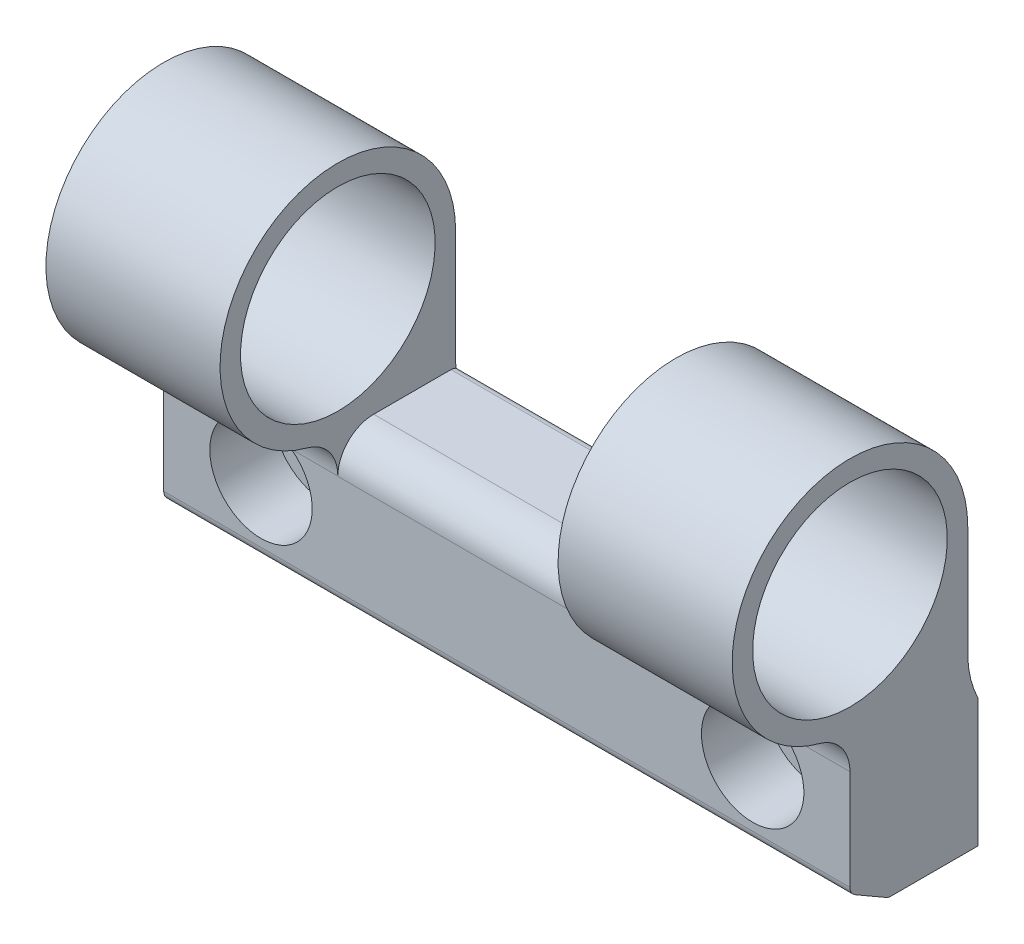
ISO-10303-21;
HEADER;
FILE_DESCRIPTION(('STEP AP214'),'2;1');
FILE_NAME('part.step','',(''),(''),'','','');
FILE_SCHEMA(('AUTOMOTIVE_DESIGN { 1 0 10303 214 1 1 1 1 }'));
ENDSEC;
DATA;
#1=APPLICATION_CONTEXT('core data for automotive mechanical design processes');
#2=APPLICATION_PROTOCOL_DEFINITION('international standard','automotive_design',2000,#1);
#3=PRODUCT_CONTEXT('',#1,'mechanical');
#4=PRODUCT('Part','Part','',(#3));
#5=PRODUCT_RELATED_PRODUCT_CATEGORY('part','',(#4));
#6=PRODUCT_DEFINITION_FORMATION('','',#4);
#7=PRODUCT_DEFINITION_CONTEXT('part definition',#1,'design');
#8=PRODUCT_DEFINITION('design','',#6,#7);
#9=PRODUCT_DEFINITION_SHAPE('','',#8);
#10=(LENGTH_UNIT() NAMED_UNIT(*) SI_UNIT(.MILLI.,.METRE.));
#11=(NAMED_UNIT(*) PLANE_ANGLE_UNIT() SI_UNIT($,.RADIAN.));
#12=(NAMED_UNIT(*) SI_UNIT($,.STERADIAN.) SOLID_ANGLE_UNIT());
#13=UNCERTAINTY_MEASURE_WITH_UNIT(LENGTH_MEASURE(1.E-05),#10,'distance_accuracy_value','');
#14=(GEOMETRIC_REPRESENTATION_CONTEXT(3) GLOBAL_UNCERTAINTY_ASSIGNED_CONTEXT((#13)) GLOBAL_UNIT_ASSIGNED_CONTEXT((#10,
#11,#12)) REPRESENTATION_CONTEXT('',''));
#15=CARTESIAN_POINT('',(0.,0.,0.));
#16=DIRECTION('',(0.,0.,1.));
#17=DIRECTION('',(1.,0.,0.));
#18=AXIS2_PLACEMENT_3D('',#15,#16,#17);
#19=CARTESIAN_POINT('',(57.5,4.02502086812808,16.5));
#20=DIRECTION('',(-1.,0.,0.));
#21=DIRECTION('',(0.,-1.,0.));
#22=AXIS2_PLACEMENT_3D('',#19,#20,#21);
#23=CYLINDRICAL_SURFACE('',#22,4.);
#24=DIRECTION('',(-1.,0.,0.));
#25=VECTOR('',#24,1.);
#26=CARTESIAN_POINT('',(57.5,4.02502086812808,12.5));
#27=LINE('',#26,#25);
#28=CARTESIAN_POINT('',(-2.9663457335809,4.02502086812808,12.5));
#29=VERTEX_POINT('',#28);
#30=CARTESIAN_POINT('',(-9.5,4.02502086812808,12.5));
#31=VERTEX_POINT('',#30);
#32=EDGE_CURVE('E156',#29,#31,#27,.T.);
#33=ORIENTED_EDGE('',*,*,#32,.F.);
#34=CARTESIAN_POINT('',(-2.9663457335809,4.02502086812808,12.5));
#35=CARTESIAN_POINT('',(-2.85427097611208,4.10763603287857,12.500022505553));
#36=CARTESIAN_POINT('',(-2.73876926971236,4.18551584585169,12.5025597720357));
#37=CARTESIAN_POINT('',(-2.50181636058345,4.33130646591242,12.5110695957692));
#38=CARTESIAN_POINT('',(-2.3803676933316,4.39922147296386,12.5170407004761));
#39=CARTESIAN_POINT('',(-2.13224254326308,4.5246985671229,12.5308314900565));
#40=CARTESIAN_POINT('',(-2.00556247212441,4.58225339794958,12.5386524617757));
#41=CARTESIAN_POINT('',(-1.74786156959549,4.68660888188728,12.5547378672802));
#42=CARTESIAN_POINT('',(-1.61684034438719,4.73340855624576,12.5630023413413));
#43=CARTESIAN_POINT('',(-1.3513403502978,4.81593191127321,12.5787470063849));
#44=CARTESIAN_POINT('',(-1.21686238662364,4.8516581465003,12.5862273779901));
#45=CARTESIAN_POINT('',(-0.945315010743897,4.91179354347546,12.5994123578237));
#46=CARTESIAN_POINT('',(-0.808245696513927,4.9362031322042,12.6051170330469));
#47=CARTESIAN_POINT('',(-0.532623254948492,4.97349264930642,12.6140291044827));
#48=CARTESIAN_POINT('',(-0.394071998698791,4.98638569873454,12.6172393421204));
#49=CARTESIAN_POINT('',(-0.116340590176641,5.00057975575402,12.6207811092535));
#50=CARTESIAN_POINT('',(0.0228395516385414,5.00188095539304,12.621112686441));
#51=CARTESIAN_POINT('',(0.299797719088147,4.99291299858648,12.6188654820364));
#52=CARTESIAN_POINT('',(0.437578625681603,4.98272706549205,12.6163076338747));
#53=CARTESIAN_POINT('',(0.711757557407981,4.95100467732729,12.6086224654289));
#54=CARTESIAN_POINT('',(0.848155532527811,4.92946781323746,12.6034950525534));
#55=CARTESIAN_POINT('',(1.11872476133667,4.8751934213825,12.591294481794));
#56=CARTESIAN_POINT('',(1.25289413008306,4.84244687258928,12.5842197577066));
#57=CARTESIAN_POINT('',(1.51800427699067,4.76599327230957,12.5690360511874));
#58=CARTESIAN_POINT('',(1.64894532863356,4.7222871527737,12.5609271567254));
#59=CARTESIAN_POINT('',(1.88362651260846,4.63300797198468,12.5462663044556));
#60=CARTESIAN_POINT('',(1.98803225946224,4.58917647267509,12.539696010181));
#61=CARTESIAN_POINT('',(2.19365140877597,4.49451890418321,12.5273625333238));
#62=CARTESIAN_POINT('',(2.29486549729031,4.44369435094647,12.5215991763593));
#63=CARTESIAN_POINT('',(2.49351285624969,4.33533935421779,12.5116843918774));
#64=CARTESIAN_POINT('',(2.59095199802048,4.27781993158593,12.5075303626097));
#65=CARTESIAN_POINT('',(2.78180056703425,4.15624966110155,12.5016922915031));
#66=CARTESIAN_POINT('',(2.87520819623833,4.09219594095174,12.5000093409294));
#67=CARTESIAN_POINT('',(2.9663457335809,4.02502086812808,12.5));
#68=B_SPLINE_CURVE_WITH_KNOTS('',3,(#34,#35,#36,#37,#38,#39,#40,#41,#42,#43,#44,#45,#46,#47,#48,
#49,#50,#51,#52,#53,#54,#55,#56,#57,#58,#59,#60,#61,#62,#63,#64,#65,#66,#67),.UNSPECIFIED.,.F.,
.F.,(4,2,2,2,2,2,2,2,2,2,2,2,2,2,2,2,4),(0.,0.417486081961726,0.834795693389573,
1.25239646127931,1.67003521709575,2.08757755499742,2.50510413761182,2.92215441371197,
3.33919778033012,3.75323900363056,4.16729514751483,4.58168529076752,4.99604020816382,
5.33606034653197,5.67600689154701,6.01540153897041,6.35494602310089),.UNSPECIFIED.);
#69=CARTESIAN_POINT('',(2.9663457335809,4.02502086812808,12.5));
#70=VERTEX_POINT('',#69);
#71=EDGE_CURVE('E27',#29,#70,#68,.T.);
#72=ORIENTED_EDGE('',*,*,#71,.T.);
#73=CARTESIAN_POINT('',(7.5,4.02502086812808,12.5));
#74=VERTEX_POINT('',#73);
#75=EDGE_CURVE('E154',#74,#70,#27,.T.);
#76=ORIENTED_EDGE('',*,*,#75,.F.);
#77=CARTESIAN_POINT('',(7.5,4.02502086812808,16.5));
#78=DIRECTION('',(1.,0.,0.));
#79=DIRECTION('',(0.,1.,0.));
#80=AXIS2_PLACEMENT_3D('',#77,#78,#79);
#81=CIRCLE('',#80,4.);
#82=CARTESIAN_POINT('',(7.5,7.88953161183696,15.4677419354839));
#83=VERTEX_POINT('',#82);
#84=EDGE_CURVE('E420',#74,#83,#81,.T.);
#85=ORIENTED_EDGE('',*,*,#84,.T.);
#86=DIRECTION('',(-1.,0.,0.));
#87=VECTOR('',#86,1.);
#88=CARTESIAN_POINT('',(57.5,7.88953161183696,15.4677419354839));
#89=LINE('',#88,#87);
#90=CARTESIAN_POINT('',(-9.5,7.88953161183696,15.4677419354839));
#91=VERTEX_POINT('',#90);
#92=EDGE_CURVE('E171',#83,#91,#89,.T.);
#93=ORIENTED_EDGE('',*,*,#92,.T.);
#94=CARTESIAN_POINT('',(-9.5,4.02502086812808,16.5));
#95=DIRECTION('',(1.,0.,0.));
#96=DIRECTION('',(0.,1.,0.));
#97=AXIS2_PLACEMENT_3D('',#94,#95,#96);
#98=CIRCLE('',#97,4.);
#99=EDGE_CURVE('E375',#31,#91,#98,.T.);
#100=ORIENTED_EDGE('',*,*,#99,.F.);
#101=EDGE_LOOP('',(#33,#72,#76,#85,#93,#100));
#102=FACE_BOUND('',#101,.T.);
#103=ADVANCED_FACE('F14',(#102),#23,.F.);
#104=CARTESIAN_POINT('',(45.0336542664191,4.02502086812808,12.5));
#105=VERTEX_POINT('',#104);
#106=CARTESIAN_POINT('',(40.5,4.02502086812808,12.5));
#107=VERTEX_POINT('',#106);
#108=EDGE_CURVE('E164',#105,#107,#27,.T.);
#109=ORIENTED_EDGE('',*,*,#108,.F.);
#110=CARTESIAN_POINT('',(45.0336542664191,4.02502086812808,12.5));
#111=CARTESIAN_POINT('',(45.1457290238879,4.10763603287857,12.500022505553));
#112=CARTESIAN_POINT('',(45.2612307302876,4.18551584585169,12.5025597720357));
#113=CARTESIAN_POINT('',(45.4981836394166,4.33130646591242,12.5110695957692));
#114=CARTESIAN_POINT('',(45.6196323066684,4.39922147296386,12.5170407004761));
#115=CARTESIAN_POINT('',(45.8677574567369,4.5246985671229,12.5308314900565));
#116=CARTESIAN_POINT('',(45.9944375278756,4.58225339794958,12.5386524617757));
#117=CARTESIAN_POINT('',(46.2521384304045,4.68660888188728,12.5547378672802));
#118=CARTESIAN_POINT('',(46.3831596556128,4.73340855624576,12.5630023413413));
#119=CARTESIAN_POINT('',(46.6486596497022,4.81593191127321,12.5787470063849));
#120=CARTESIAN_POINT('',(46.7831376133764,4.8516581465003,12.5862273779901));
#121=CARTESIAN_POINT('',(47.0546849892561,4.91179354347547,12.5994123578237));
#122=CARTESIAN_POINT('',(47.1917543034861,4.9362031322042,12.6051170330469));
#123=CARTESIAN_POINT('',(47.4673767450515,4.97349264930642,12.6140291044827));
#124=CARTESIAN_POINT('',(47.6059280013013,4.98638569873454,12.6172393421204));
#125=CARTESIAN_POINT('',(47.8836594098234,5.00057975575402,12.6207811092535));
#126=CARTESIAN_POINT('',(48.0228395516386,5.00188095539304,12.621112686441));
#127=CARTESIAN_POINT('',(48.2997977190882,4.99291299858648,12.6188654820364));
#128=CARTESIAN_POINT('',(48.4375786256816,4.98272706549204,12.6163076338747));
#129=CARTESIAN_POINT('',(48.711757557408,4.95100467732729,12.6086224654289));
#130=CARTESIAN_POINT('',(48.8481555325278,4.92946781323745,12.6034950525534));
#131=CARTESIAN_POINT('',(49.1187247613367,4.87519342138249,12.591294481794));
#132=CARTESIAN_POINT('',(49.2528941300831,4.84244687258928,12.5842197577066));
#133=CARTESIAN_POINT('',(49.5180042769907,4.76599327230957,12.5690360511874));
#134=CARTESIAN_POINT('',(49.6489453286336,4.7222871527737,12.5609271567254));
#135=CARTESIAN_POINT('',(49.8836265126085,4.63300797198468,12.5462663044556));
#136=CARTESIAN_POINT('',(49.9880322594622,4.58917647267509,12.539696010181));
#137=CARTESIAN_POINT('',(50.193651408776,4.49451890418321,12.5273625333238));
#138=CARTESIAN_POINT('',(50.2948654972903,4.44369435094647,12.5215991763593));
#139=CARTESIAN_POINT('',(50.4935128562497,4.33533935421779,12.5116843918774));
#140=CARTESIAN_POINT('',(50.5909519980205,4.27781993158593,12.5075303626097));
#141=CARTESIAN_POINT('',(50.7818005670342,4.15624966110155,12.5016922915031));
#142=CARTESIAN_POINT('',(50.8752081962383,4.09219594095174,12.5000093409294));
#143=CARTESIAN_POINT('',(50.9663457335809,4.02502086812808,12.5));
#144=B_SPLINE_CURVE_WITH_KNOTS('',3,(#110,#111,#112,#113,#114,#115,#116,#117,#118,#119,#120,
#121,#122,#123,#124,#125,#126,#127,#128,#129,#130,#131,#132,#133,#134,#135,#136,#137,#138,#139,
#140,#141,#142,#143),.UNSPECIFIED.,.F.,.F.,(4,2,2,2,2,2,2,2,2,2,2,2,2,2,2,2,4),(0.,
0.417486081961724,0.834795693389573,1.2523964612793,1.67003521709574,2.08757755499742,
2.50510413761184,2.92215441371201,3.33919778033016,3.75323900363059,4.16729514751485,
4.58168529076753,4.99604020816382,5.33606034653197,5.67600689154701,6.01540153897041,
6.35494602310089),.UNSPECIFIED.);
#145=CARTESIAN_POINT('',(50.9663457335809,4.02502086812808,12.5));
#146=VERTEX_POINT('',#145);
#147=EDGE_CURVE('E34',#105,#146,#144,.T.);
#148=ORIENTED_EDGE('',*,*,#147,.T.);
#149=CARTESIAN_POINT('',(57.5,4.02502086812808,12.5));
#150=VERTEX_POINT('',#149);
#151=EDGE_CURVE('E166',#150,#146,#27,.T.);
#152=ORIENTED_EDGE('',*,*,#151,.F.);
#153=CARTESIAN_POINT('',(57.5,4.02502086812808,16.5));
#154=DIRECTION('',(1.,0.,0.));
#155=DIRECTION('',(0.,1.,0.));
#156=AXIS2_PLACEMENT_3D('',#153,#154,#155);
#157=CIRCLE('',#156,4.);
#158=CARTESIAN_POINT('',(57.5,7.88953161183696,15.4677419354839));
#159=VERTEX_POINT('',#158);
#160=EDGE_CURVE('E351',#150,#159,#157,.T.);
#161=ORIENTED_EDGE('',*,*,#160,.T.);
#162=CARTESIAN_POINT('',(40.5,7.88953161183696,15.4677419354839));
#163=VERTEX_POINT('',#162);
#164=EDGE_CURVE('E173',#159,#163,#89,.T.);
#165=ORIENTED_EDGE('',*,*,#164,.T.);
#166=CARTESIAN_POINT('',(40.5,4.02502086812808,16.5));
#167=DIRECTION('',(1.,0.,0.));
#168=DIRECTION('',(0.,1.,0.));
#169=AXIS2_PLACEMENT_3D('',#166,#167,#168);
#170=CIRCLE('',#169,4.);
#171=EDGE_CURVE('E409',#107,#163,#170,.T.);
#172=ORIENTED_EDGE('',*,*,#171,.F.);
#173=EDGE_LOOP('',(#109,#148,#152,#161,#165,#172));
#174=FACE_BOUND('',#173,.T.);
#175=ADVANCED_FACE('F207',(#174),#23,.F.);
#176=CARTESIAN_POINT('',(57.5,8.,1.));
#177=DIRECTION('',(0.,0.,1.));
#178=DIRECTION('',(1.,0.,0.));
#179=AXIS2_PLACEMENT_3D('',#176,#177,#178);
#180=PLANE('',#179);
#181=DIRECTION('',(0.,1.,0.));
#182=VECTOR('',#181,1.);
#183=CARTESIAN_POINT('',(7.5,8.,1.));
#184=LINE('',#183,#182);
#185=CARTESIAN_POINT('',(7.5,8.,1.));
#186=VERTEX_POINT('',#185);
#187=CARTESIAN_POINT('',(7.5,19.,1.));
#188=VERTEX_POINT('',#187);
#189=EDGE_CURVE('E416',#186,#188,#184,.T.);
#190=ORIENTED_EDGE('',*,*,#189,.F.);
#191=DIRECTION('',(-1.,0.,0.));
#192=VECTOR('',#191,1.);
#193=CARTESIAN_POINT('',(57.5,8.,1.));
#194=LINE('',#193,#192);
#195=CARTESIAN_POINT('',(-9.5,8.,1.));
#196=VERTEX_POINT('',#195);
#197=EDGE_CURVE('E182',#186,#196,#194,.T.);
#198=ORIENTED_EDGE('',*,*,#197,.T.);
#199=DIRECTION('',(0.,1.,0.));
#200=VECTOR('',#199,1.);
#201=CARTESIAN_POINT('',(-9.5,8.,1.));
#202=LINE('',#201,#200);
#203=CARTESIAN_POINT('',(-9.5,19.,1.));
#204=VERTEX_POINT('',#203);
#205=EDGE_CURVE('E370',#196,#204,#202,.T.);
#206=ORIENTED_EDGE('',*,*,#205,.T.);
#207=DIRECTION('',(-1.,0.,0.));
#208=VECTOR('',#207,1.);
#209=CARTESIAN_POINT('',(57.5,19.,1.));
#210=LINE('',#209,#208);
#211=EDGE_CURVE('E177',#188,#204,#210,.T.);
#212=ORIENTED_EDGE('',*,*,#211,.F.);
#213=EDGE_LOOP('',(#190,#198,#206,#212));
#214=FACE_BOUND('',#213,.T.);
#215=ADVANCED_FACE('F294',(#214),#180,.F.);
#216=CARTESIAN_POINT('',(57.5,19.,12.5));
#217=DIRECTION('',(-1.,0.,0.));
#218=DIRECTION('',(0.,-1.,0.));
#219=AXIS2_PLACEMENT_3D('',#216,#217,#218);
#220=CYLINDRICAL_SURFACE('',#219,11.5);
#221=CARTESIAN_POINT('',(7.5,19.,12.5));
#222=DIRECTION('',(1.,0.,0.));
#223=DIRECTION('',(0.,1.,0.));
#224=AXIS2_PLACEMENT_3D('',#221,#222,#223);
#225=CIRCLE('',#224,11.5);
#226=EDGE_CURVE('E418',#188,#83,#225,.T.);
#227=ORIENTED_EDGE('',*,*,#226,.F.);
#228=ORIENTED_EDGE('',*,*,#211,.T.);
#229=CARTESIAN_POINT('',(-9.5,19.,12.5));
#230=DIRECTION('',(1.,0.,0.));
#231=DIRECTION('',(0.,1.,0.));
#232=AXIS2_PLACEMENT_3D('',#229,#230,#231);
#233=CIRCLE('',#232,11.5);
#234=EDGE_CURVE('E373',#204,#91,#233,.T.);
#235=ORIENTED_EDGE('',*,*,#234,.T.);
#236=ORIENTED_EDGE('',*,*,#92,.F.);
#237=EDGE_LOOP('',(#227,#228,#235,#236));
#238=FACE_BOUND('',#237,.T.);
#239=ADVANCED_FACE('F288',(#238),#220,.T.);
#240=CARTESIAN_POINT('',(57.5,19.,12.5));
#241=DIRECTION('',(-1.,0.,0.));
#242=DIRECTION('',(0.,-1.,0.));
#243=AXIS2_PLACEMENT_3D('',#240,#241,#242);
#244=CYLINDRICAL_SURFACE('',#243,9.5);
#245=CARTESIAN_POINT('',(-9.5,19.,12.5));
#246=DIRECTION('',(1.,0.,0.));
#247=DIRECTION('',(0.,1.,0.));
#248=AXIS2_PLACEMENT_3D('',#245,#246,#247);
#249=CIRCLE('',#248,9.5);
#250=CARTESIAN_POINT('',(-9.5,28.5,12.5));
#251=VERTEX_POINT('',#250);
#252=EDGE_CURVE('E343',#251,#251,#249,.T.);
#253=ORIENTED_EDGE('',*,*,#252,.F.);
#254=EDGE_LOOP('',(#253));
#255=FACE_BOUND('',#254,.T.);
#256=CARTESIAN_POINT('',(7.5,19.,12.5));
#257=DIRECTION('',(1.,0.,0.));
#258=DIRECTION('',(0.,1.,0.));
#259=AXIS2_PLACEMENT_3D('',#256,#257,#258);
#260=CIRCLE('',#259,9.5);
#261=CARTESIAN_POINT('',(7.5,28.5,12.5));
#262=VERTEX_POINT('',#261);
#263=EDGE_CURVE('E195',#262,#262,#260,.T.);
#264=ORIENTED_EDGE('',*,*,#263,.T.);
#265=EDGE_LOOP('',(#264));
#266=FACE_BOUND('',#265,.T.);
#267=ADVANCED_FACE('F273',(#255,#266),#244,.F.);
#268=CARTESIAN_POINT('',(57.5,-7.5,8.48205080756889));
#269=DIRECTION('',(-1.,0.,0.));
#270=DIRECTION('',(0.,-1.,0.));
#271=AXIS2_PLACEMENT_3D('',#268,#269,#270);
#272=CYLINDRICAL_SURFACE('',#271,0.999999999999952);
#273=CARTESIAN_POINT('',(-9.5,-7.5,8.48205080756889));
#274=DIRECTION('',(1.,0.,0.));
#275=DIRECTION('',(0.,1.,0.));
#276=AXIS2_PLACEMENT_3D('',#273,#274,#275);
#277=CIRCLE('',#276,0.999999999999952);
#278=CARTESIAN_POINT('',(-9.5,-8.36602540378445,8.98205080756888));
#279=VERTEX_POINT('',#278);
#280=CARTESIAN_POINT('',(-9.5,-8.5,8.48205080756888));
#281=VERTEX_POINT('',#280);
#282=EDGE_CURVE('E330',#279,#281,#277,.T.);
#283=ORIENTED_EDGE('',*,*,#282,.T.);
#284=DIRECTION('',(-1.,0.,0.));
#285=VECTOR('',#284,1.);
#286=CARTESIAN_POINT('',(57.5,-8.5,8.48205080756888));
#287=LINE('',#286,#285);
#288=CARTESIAN_POINT('',(57.5,-8.5,8.48205080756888));
#289=VERTEX_POINT('',#288);
#290=EDGE_CURVE('E191',#289,#281,#287,.T.);
#291=ORIENTED_EDGE('',*,*,#290,.F.);
#292=CARTESIAN_POINT('',(57.5,-7.5,8.48205080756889));
#293=DIRECTION('',(1.,0.,0.));
#294=DIRECTION('',(0.,1.,0.));
#295=AXIS2_PLACEMENT_3D('',#292,#293,#294);
#296=CIRCLE('',#295,0.999999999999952);
#297=CARTESIAN_POINT('',(57.5,-8.36602540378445,8.98205080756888));
#298=VERTEX_POINT('',#297);
#299=EDGE_CURVE('E339',#298,#289,#296,.T.);
#300=ORIENTED_EDGE('',*,*,#299,.F.);
#301=DIRECTION('',(-1.,0.,0.));
#302=VECTOR('',#301,1.);
#303=CARTESIAN_POINT('',(57.5,-8.36602540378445,8.98205080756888));
#304=LINE('',#303,#302);
#305=EDGE_CURVE('E361',#298,#279,#304,.T.);
#306=ORIENTED_EDGE('',*,*,#305,.T.);
#307=EDGE_LOOP('',(#283,#291,#300,#306));
#308=FACE_BOUND('',#307,.T.);
#309=ADVANCED_FACE('F16',(#308),#272,.T.);
#310=CARTESIAN_POINT('',(57.5,-8.5,8.48205080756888));
#311=DIRECTION('',(0.,1.,0.));
#312=DIRECTION('',(-1.,0.,0.));
#313=AXIS2_PLACEMENT_3D('',#310,#311,#312);
#314=PLANE('',#313);
#315=DIRECTION('',(0.,0.,-1.));
#316=VECTOR('',#315,1.);
#317=CARTESIAN_POINT('',(-9.5,-8.5,8.48205080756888));
#318=LINE('',#317,#316);
#319=CARTESIAN_POINT('',(-9.5,-8.5,0.));
#320=VERTEX_POINT('',#319);
#321=EDGE_CURVE('E333',#281,#320,#318,.T.);
#322=ORIENTED_EDGE('',*,*,#321,.T.);
#323=DIRECTION('',(-1.,0.,0.));
#324=VECTOR('',#323,1.);
#325=CARTESIAN_POINT('',(57.5,-8.5,0.));
#326=LINE('',#325,#324);
#327=CARTESIAN_POINT('',(57.5,-8.5,0.));
#328=VERTEX_POINT('',#327);
#329=EDGE_CURVE('E188',#328,#320,#326,.T.);
#330=ORIENTED_EDGE('',*,*,#329,.F.);
#331=DIRECTION('',(0.,0.,-1.));
#332=VECTOR('',#331,1.);
#333=CARTESIAN_POINT('',(57.5,-8.5,8.48205080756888));
#334=LINE('',#333,#332);
#335=EDGE_CURVE('E342',#289,#328,#334,.T.);
#336=ORIENTED_EDGE('',*,*,#335,.F.);
#337=ORIENTED_EDGE('',*,*,#290,.T.);
#338=EDGE_LOOP('',(#322,#330,#336,#337));
#339=FACE_BOUND('',#338,.T.);
#340=ADVANCED_FACE('F457',(#339),#314,.F.);
#341=CARTESIAN_POINT('',(57.5,-8.5,0.));
#342=DIRECTION('',(0.,0.,1.));
#343=DIRECTION('',(1.,0.,0.));
#344=AXIS2_PLACEMENT_3D('',#341,#342,#343);
#345=PLANE('',#344);
#346=CARTESIAN_POINT('',(0.,0.,0.));
#347=DIRECTION('',(0.,0.,-1.));
#348=DIRECTION('',(-1.,0.,0.));
#349=AXIS2_PLACEMENT_3D('',#346,#347,#348);
#350=CIRCLE('',#349,3.25);
#351=CARTESIAN_POINT('',(-3.25,0.,0.));
#352=VERTEX_POINT('',#351);
#353=EDGE_CURVE('E657',#352,#352,#350,.T.);
#354=ORIENTED_EDGE('',*,*,#353,.F.);
#355=EDGE_LOOP('',(#354));
#356=FACE_BOUND('',#355,.T.);
#357=CARTESIAN_POINT('',(48.,0.,0.));
#358=DIRECTION('',(0.,0.,-1.));
#359=DIRECTION('',(-1.,0.,0.));
#360=AXIS2_PLACEMENT_3D('',#357,#358,#359);
#361=CIRCLE('',#360,3.25);
#362=CARTESIAN_POINT('',(44.75,0.,0.));
#363=VERTEX_POINT('',#362);
#364=EDGE_CURVE('E157',#363,#363,#361,.T.);
#365=ORIENTED_EDGE('',*,*,#364,.F.);
#366=EDGE_LOOP('',(#365));
#367=FACE_BOUND('',#366,.T.);
#368=DIRECTION('',(0.,1.,0.));
#369=VECTOR('',#368,1.);
#370=CARTESIAN_POINT('',(-9.5,-8.5,0.));
#371=LINE('',#370,#369);
#372=CARTESIAN_POINT('',(-9.5,4.,0.));
#373=VERTEX_POINT('',#372);
#374=EDGE_CURVE('E364',#320,#373,#371,.T.);
#375=ORIENTED_EDGE('',*,*,#374,.T.);
#376=DIRECTION('',(-1.,0.,0.));
#377=VECTOR('',#376,1.);
#378=CARTESIAN_POINT('',(57.5,4.,0.));
#379=LINE('',#378,#377);
#380=CARTESIAN_POINT('',(57.5,4.,0.));
#381=VERTEX_POINT('',#380);
#382=EDGE_CURVE('E186',#381,#373,#379,.T.);
#383=ORIENTED_EDGE('',*,*,#382,.F.);
#384=DIRECTION('',(0.,1.,0.));
#385=VECTOR('',#384,1.);
#386=CARTESIAN_POINT('',(57.5,-8.5,0.));
#387=LINE('',#386,#385);
#388=EDGE_CURVE('E345',#328,#381,#387,.T.);
#389=ORIENTED_EDGE('',*,*,#388,.F.);
#390=ORIENTED_EDGE('',*,*,#329,.T.);
#391=EDGE_LOOP('',(#375,#383,#389,#390));
#392=FACE_BOUND('',#391,.T.);
#393=ADVANCED_FACE('F315',(#356,#367,#392),#345,.F.);
#394=CARTESIAN_POINT('',(57.5,8.37325787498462,-8.99303149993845));
#395=DIRECTION('',(-1.,0.,0.));
#396=DIRECTION('',(0.,-1.,0.));
#397=AXIS2_PLACEMENT_3D('',#394,#395,#396);
#398=CYLINDRICAL_SURFACE('',#397,10.);
#399=CARTESIAN_POINT('',(40.5,8.37325787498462,-8.99303149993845));
#400=DIRECTION('',(1.,0.,0.));
#401=DIRECTION('',(0.,1.,0.));
#402=AXIS2_PLACEMENT_3D('',#399,#400,#401);
#403=CIRCLE('',#402,10.);
#404=CARTESIAN_POINT('',(40.5,8.,1.));
#405=VERTEX_POINT('',#404);
#406=CARTESIAN_POINT('',(40.5,7.36760936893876,0.956273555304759));
#407=VERTEX_POINT('',#406);
#408=EDGE_CURVE('E327',#405,#407,#403,.T.);
#409=ORIENTED_EDGE('',*,*,#408,.F.);
#410=CARTESIAN_POINT('',(57.5,8.,1.));
#411=VERTEX_POINT('',#410);
#412=EDGE_CURVE('E183',#411,#405,#194,.T.);
#413=ORIENTED_EDGE('',*,*,#412,.F.);
#414=CARTESIAN_POINT('',(57.5,8.37325787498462,-8.99303149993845));
#415=DIRECTION('',(1.,0.,0.));
#416=DIRECTION('',(0.,1.,0.));
#417=AXIS2_PLACEMENT_3D('',#414,#415,#416);
#418=CIRCLE('',#417,10.);
#419=EDGE_CURVE('E325',#411,#381,#418,.T.);
#420=ORIENTED_EDGE('',*,*,#419,.T.);
#421=ORIENTED_EDGE('',*,*,#382,.T.);
#422=CARTESIAN_POINT('',(-9.5,8.37325787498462,-8.99303149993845));
#423=DIRECTION('',(1.,0.,0.));
#424=DIRECTION('',(0.,1.,0.));
#425=AXIS2_PLACEMENT_3D('',#422,#423,#424);
#426=CIRCLE('',#425,10.);
#427=EDGE_CURVE('E367',#196,#373,#426,.T.);
#428=ORIENTED_EDGE('',*,*,#427,.F.);
#429=ORIENTED_EDGE('',*,*,#197,.F.);
#430=CARTESIAN_POINT('',(7.5,8.37325787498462,-8.99303149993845));
#431=DIRECTION('',(1.,0.,0.));
#432=DIRECTION('',(0.,1.,0.));
#433=AXIS2_PLACEMENT_3D('',#430,#431,#432);
#434=CIRCLE('',#433,10.);
#435=CARTESIAN_POINT('',(7.5,7.36760936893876,0.956273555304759));
#436=VERTEX_POINT('',#435);
#437=EDGE_CURVE('E203',#186,#436,#434,.T.);
#438=ORIENTED_EDGE('',*,*,#437,.T.);
#439=DIRECTION('',(-1.,0.,0.));
#440=VECTOR('',#439,1.);
#441=CARTESIAN_POINT('',(24.,7.36760936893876,0.956273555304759));
#442=LINE('',#441,#440);
#443=EDGE_CURVE('E194',#407,#436,#442,.T.);
#444=ORIENTED_EDGE('',*,*,#443,.F.);
#445=EDGE_LOOP('',(#409,#413,#420,#421,#428,#429,#438,#444));
#446=FACE_BOUND('',#445,.T.);
#447=ADVANCED_FACE('F309',(#446),#398,.F.);
#448=ORIENTED_EDGE('',*,*,#412,.T.);
#449=DIRECTION('',(0.,1.,0.));
#450=VECTOR('',#449,1.);
#451=CARTESIAN_POINT('',(40.5,8.,1.));
#452=LINE('',#451,#450);
#453=CARTESIAN_POINT('',(40.5,19.,1.));
#454=VERTEX_POINT('',#453);
#455=EDGE_CURVE('E320',#405,#454,#452,.T.);
#456=ORIENTED_EDGE('',*,*,#455,.T.);
#457=CARTESIAN_POINT('',(57.5,19.,1.));
#458=VERTEX_POINT('',#457);
#459=EDGE_CURVE('E179',#458,#454,#210,.T.);
#460=ORIENTED_EDGE('',*,*,#459,.F.);
#461=DIRECTION('',(0.,1.,0.));
#462=VECTOR('',#461,1.);
#463=CARTESIAN_POINT('',(57.5,8.,1.));
#464=LINE('',#463,#462);
#465=EDGE_CURVE('E321',#411,#458,#464,.T.);
#466=ORIENTED_EDGE('',*,*,#465,.F.);
#467=EDGE_LOOP('',(#448,#456,#460,#466));
#468=FACE_BOUND('',#467,.T.);
#469=ADVANCED_FACE('F286',(#468),#180,.F.);
#470=ORIENTED_EDGE('',*,*,#459,.T.);
#471=CARTESIAN_POINT('',(40.5,19.,12.5));
#472=DIRECTION('',(1.,0.,0.));
#473=DIRECTION('',(0.,1.,0.));
#474=AXIS2_PLACEMENT_3D('',#471,#472,#473);
#475=CIRCLE('',#474,11.5);
#476=EDGE_CURVE('E335',#454,#163,#475,.T.);
#477=ORIENTED_EDGE('',*,*,#476,.T.);
#478=ORIENTED_EDGE('',*,*,#164,.F.);
#479=CARTESIAN_POINT('',(57.5,19.,12.5));
#480=DIRECTION('',(1.,0.,0.));
#481=DIRECTION('',(0.,1.,0.));
#482=AXIS2_PLACEMENT_3D('',#479,#480,#481);
#483=CIRCLE('',#482,11.5);
#484=EDGE_CURVE('E349',#458,#159,#483,.T.);
#485=ORIENTED_EDGE('',*,*,#484,.F.);
#486=EDGE_LOOP('',(#470,#477,#478,#485));
#487=FACE_BOUND('',#486,.T.);
#488=ADVANCED_FACE('F280',(#487),#220,.T.);
#489=CARTESIAN_POINT('',(57.5,4.02502086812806,12.5));
#490=DIRECTION('',(0.,0.,-1.));
#491=DIRECTION('',(-1.,0.,0.));
#492=AXIS2_PLACEMENT_3D('',#489,#490,#491);
#493=PLANE('',#492);
#494=ORIENTED_EDGE('',*,*,#75,.T.);
#495=CARTESIAN_POINT('',(0.,0.,12.5));
#496=DIRECTION('',(0.,0.,-1.));
#497=DIRECTION('',(-1.,0.,0.));
#498=AXIS2_PLACEMENT_3D('',#495,#496,#497);
#499=CIRCLE('',#498,5.);
#500=EDGE_CURVE('E9',#29,#70,#499,.F.);
#501=ORIENTED_EDGE('',*,*,#500,.F.);
#502=ORIENTED_EDGE('',*,*,#32,.T.);
#503=DIRECTION('',(0.,-1.,0.));
#504=VECTOR('',#503,1.);
#505=CARTESIAN_POINT('',(-9.5,4.02502086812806,12.5));
#506=LINE('',#505,#504);
#507=CARTESIAN_POINT('',(-9.5,-5.7575862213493,12.5));
#508=VERTEX_POINT('',#507);
#509=EDGE_CURVE('E378',#31,#508,#506,.T.);
#510=ORIENTED_EDGE('',*,*,#509,.T.);
#511=DIRECTION('',(-1.,0.,0.));
#512=VECTOR('',#511,1.);
#513=CARTESIAN_POINT('',(57.5,-5.7575862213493,12.5));
#514=LINE('',#513,#512);
#515=CARTESIAN_POINT('',(57.5,-5.7575862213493,12.5));
#516=VERTEX_POINT('',#515);
#517=EDGE_CURVE('E167',#516,#508,#514,.T.);
#518=ORIENTED_EDGE('',*,*,#517,.F.);
#519=DIRECTION('',(0.,-1.,0.));
#520=VECTOR('',#519,1.);
#521=CARTESIAN_POINT('',(57.5,4.02502086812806,12.5));
#522=LINE('',#521,#520);
#523=EDGE_CURVE('E353',#150,#516,#522,.T.);
#524=ORIENTED_EDGE('',*,*,#523,.F.);
#525=ORIENTED_EDGE('',*,*,#151,.T.);
#526=CARTESIAN_POINT('',(48.,0.,12.5));
#527=DIRECTION('',(0.,0.,-1.));
#528=DIRECTION('',(-1.,0.,0.));
#529=AXIS2_PLACEMENT_3D('',#526,#527,#528);
#530=CIRCLE('',#529,5.);
#531=EDGE_CURVE('E22',#105,#146,#530,.F.);
#532=ORIENTED_EDGE('',*,*,#531,.F.);
#533=ORIENTED_EDGE('',*,*,#108,.T.);
#534=DIRECTION('',(0.,-1.,0.));
#535=VECTOR('',#534,1.);
#536=CARTESIAN_POINT('',(40.5,4.02502086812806,12.5));
#537=LINE('',#536,#535);
#538=CARTESIAN_POINT('',(40.5,4.,12.5));
#539=VERTEX_POINT('',#538);
#540=EDGE_CURVE('E202',#107,#539,#537,.T.);
#541=ORIENTED_EDGE('',*,*,#540,.T.);
#542=DIRECTION('',(-1.,0.,0.));
#543=VECTOR('',#542,1.);
#544=CARTESIAN_POINT('',(40.5,4.,12.5));
#545=LINE('',#544,#543);
#546=CARTESIAN_POINT('',(7.5,4.,12.5));
#547=VERTEX_POINT('',#546);
#548=EDGE_CURVE('E198',#539,#547,#545,.T.);
#549=ORIENTED_EDGE('',*,*,#548,.T.);
#550=DIRECTION('',(0.,-1.,0.));
#551=VECTOR('',#550,1.);
#552=CARTESIAN_POINT('',(7.5,4.02502086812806,12.5));
#553=LINE('',#552,#551);
#554=EDGE_CURVE('E163',#74,#547,#553,.T.);
#555=ORIENTED_EDGE('',*,*,#554,.F.);
#556=EDGE_LOOP('',(#494,#501,#502,#510,#518,#524,#525,#532,#533,#541,#549,#555));
#557=FACE_BOUND('',#556,.T.);
#558=ADVANCED_FACE('F161',(#557),#493,.F.);
#559=CARTESIAN_POINT('',(57.5,-5.7575862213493,11.5));
#560=DIRECTION('',(-1.,0.,0.));
#561=DIRECTION('',(0.,-1.,0.));
#562=AXIS2_PLACEMENT_3D('',#559,#560,#561);
#563=CYLINDRICAL_SURFACE('',#562,1.);
#564=CARTESIAN_POINT('',(-9.5,-5.7575862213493,11.5));
#565=DIRECTION('',(1.,0.,0.));
#566=DIRECTION('',(0.,1.,0.));
#567=AXIS2_PLACEMENT_3D('',#564,#565,#566);
#568=CIRCLE('',#567,1.);
#569=CARTESIAN_POINT('',(-9.5,-6.6236116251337,12.));
#570=VERTEX_POINT('',#569);
#571=EDGE_CURVE('E380',#508,#570,#568,.T.);
#572=ORIENTED_EDGE('',*,*,#571,.T.);
#573=DIRECTION('',(-1.,0.,0.));
#574=VECTOR('',#573,1.);
#575=CARTESIAN_POINT('',(57.5,-6.6236116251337,12.));
#576=LINE('',#575,#574);
#577=CARTESIAN_POINT('',(57.5,-6.6236116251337,12.));
#578=VERTEX_POINT('',#577);
#579=EDGE_CURVE('E388',#578,#570,#576,.T.);
#580=ORIENTED_EDGE('',*,*,#579,.F.);
#581=CARTESIAN_POINT('',(57.5,-5.7575862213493,11.5));
#582=DIRECTION('',(1.,0.,0.));
#583=DIRECTION('',(0.,1.,0.));
#584=AXIS2_PLACEMENT_3D('',#581,#582,#583);
#585=CIRCLE('',#584,1.);
#586=EDGE_CURVE('E355',#516,#578,#585,.T.);
#587=ORIENTED_EDGE('',*,*,#586,.F.);
#588=ORIENTED_EDGE('',*,*,#517,.T.);
#589=EDGE_LOOP('',(#572,#580,#587,#588));
#590=FACE_BOUND('',#589,.T.);
#591=ADVANCED_FACE('F271',(#590),#563,.T.);
#592=CARTESIAN_POINT('',(40.5,19.,12.5));
#593=DIRECTION('',(1.,0.,0.));
#594=DIRECTION('',(0.,1.,0.));
#595=AXIS2_PLACEMENT_3D('',#592,#593,#594);
#596=CIRCLE('',#595,9.5);
#597=CARTESIAN_POINT('',(40.5,28.5,12.5));
#598=VERTEX_POINT('',#597);
#599=EDGE_CURVE('E199',#598,#598,#596,.T.);
#600=ORIENTED_EDGE('',*,*,#599,.F.);
#601=EDGE_LOOP('',(#600));
#602=FACE_BOUND('',#601,.T.);
#603=CARTESIAN_POINT('',(57.5,19.,12.5));
#604=DIRECTION('',(1.,0.,0.));
#605=DIRECTION('',(0.,1.,0.));
#606=AXIS2_PLACEMENT_3D('',#603,#604,#605);
#607=CIRCLE('',#606,9.5);
#608=CARTESIAN_POINT('',(57.5,28.5,12.5));
#609=VERTEX_POINT('',#608);
#610=EDGE_CURVE('E359',#609,#609,#607,.T.);
#611=ORIENTED_EDGE('',*,*,#610,.T.);
#612=EDGE_LOOP('',(#611));
#613=FACE_BOUND('',#612,.T.);
#614=ADVANCED_FACE('F268',(#602,#613),#244,.F.);
#615=CARTESIAN_POINT('',(57.5,-6.6236116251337,12.));
#616=DIRECTION('',(0.,0.866025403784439,-0.5));
#617=DIRECTION('',(0.,0.5,0.866025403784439));
#618=AXIS2_PLACEMENT_3D('',#615,#616,#617);
#619=PLANE('',#618);
#620=DIRECTION('',(0.,-0.5,-0.866025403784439));
#621=VECTOR('',#620,1.);
#622=CARTESIAN_POINT('',(-9.5,-6.6236116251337,12.));
#623=LINE('',#622,#621);
#624=EDGE_CURVE('E382',#570,#279,#623,.T.);
#625=ORIENTED_EDGE('',*,*,#624,.T.);
#626=ORIENTED_EDGE('',*,*,#305,.F.);
#627=DIRECTION('',(0.,-0.5,-0.866025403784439));
#628=VECTOR('',#627,1.);
#629=CARTESIAN_POINT('',(57.5,-6.6236116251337,12.));
#630=LINE('',#629,#628);
#631=EDGE_CURVE('E357',#578,#298,#630,.T.);
#632=ORIENTED_EDGE('',*,*,#631,.F.);
#633=ORIENTED_EDGE('',*,*,#579,.T.);
#634=EDGE_LOOP('',(#625,#626,#632,#633));
#635=FACE_BOUND('',#634,.T.);
#636=ADVANCED_FACE('F263',(#635),#619,.F.);
#637=CARTESIAN_POINT('',(57.5,-7.5,8.48205080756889));
#638=DIRECTION('',(1.,0.,0.));
#639=DIRECTION('',(0.,1.,0.));
#640=AXIS2_PLACEMENT_3D('',#637,#638,#639);
#641=PLANE('',#640);
#642=ORIENTED_EDGE('',*,*,#610,.F.);
#643=EDGE_LOOP('',(#642));
#644=FACE_BOUND('',#643,.T.);
#645=ORIENTED_EDGE('',*,*,#299,.T.);
#646=ORIENTED_EDGE('',*,*,#335,.T.);
#647=ORIENTED_EDGE('',*,*,#388,.T.);
#648=ORIENTED_EDGE('',*,*,#419,.F.);
#649=ORIENTED_EDGE('',*,*,#465,.T.);
#650=ORIENTED_EDGE('',*,*,#484,.T.);
#651=ORIENTED_EDGE('',*,*,#160,.F.);
#652=ORIENTED_EDGE('',*,*,#523,.T.);
#653=ORIENTED_EDGE('',*,*,#586,.T.);
#654=ORIENTED_EDGE('',*,*,#631,.T.);
#655=EDGE_LOOP('',(#645,#646,#647,#648,#649,#650,#651,#652,#653,#654));
#656=FACE_BOUND('',#655,.T.);
#657=ADVANCED_FACE('F260',(#644,#656),#641,.T.);
#658=CARTESIAN_POINT('',(-9.5,-7.5,8.48205080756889));
#659=DIRECTION('',(1.,0.,0.));
#660=DIRECTION('',(0.,1.,0.));
#661=AXIS2_PLACEMENT_3D('',#658,#659,#660);
#662=PLANE('',#661);
#663=ORIENTED_EDGE('',*,*,#252,.T.);
#664=EDGE_LOOP('',(#663));
#665=FACE_BOUND('',#664,.T.);
#666=ORIENTED_EDGE('',*,*,#282,.F.);
#667=ORIENTED_EDGE('',*,*,#624,.F.);
#668=ORIENTED_EDGE('',*,*,#571,.F.);
#669=ORIENTED_EDGE('',*,*,#509,.F.);
#670=ORIENTED_EDGE('',*,*,#99,.T.);
#671=ORIENTED_EDGE('',*,*,#234,.F.);
#672=ORIENTED_EDGE('',*,*,#205,.F.);
#673=ORIENTED_EDGE('',*,*,#427,.T.);
#674=ORIENTED_EDGE('',*,*,#374,.F.);
#675=ORIENTED_EDGE('',*,*,#321,.F.);
#676=EDGE_LOOP('',(#666,#667,#668,#669,#670,#671,#672,#673,#674,#675));
#677=FACE_BOUND('',#676,.T.);
#678=ADVANCED_FACE('F258',(#665,#677),#662,.F.);
#679=CARTESIAN_POINT('',(40.5,4.,9.));
#680=DIRECTION('',(-1.,0.,0.));
#681=DIRECTION('',(0.,-1.,0.));
#682=AXIS2_PLACEMENT_3D('',#679,#680,#681);
#683=CYLINDRICAL_SURFACE('',#682,3.5);
#684=CARTESIAN_POINT('',(7.5,4.,9.));
#685=DIRECTION('',(1.,0.,0.));
#686=DIRECTION('',(0.,1.,0.));
#687=AXIS2_PLACEMENT_3D('',#684,#685,#686);
#688=CIRCLE('',#687,3.5);
#689=CARTESIAN_POINT('',(7.5,7.5,9.00000005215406));
#690=VERTEX_POINT('',#689);
#691=EDGE_CURVE('E210',#690,#547,#688,.T.);
#692=ORIENTED_EDGE('',*,*,#691,.T.);
#693=ORIENTED_EDGE('',*,*,#548,.F.);
#694=CARTESIAN_POINT('',(40.5,4.,9.));
#695=DIRECTION('',(1.,0.,0.));
#696=DIRECTION('',(0.,1.,0.));
#697=AXIS2_PLACEMENT_3D('',#694,#695,#696);
#698=CIRCLE('',#697,3.5);
#699=CARTESIAN_POINT('',(40.5,7.5,9.00000005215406));
#700=VERTEX_POINT('',#699);
#701=EDGE_CURVE('E227',#700,#539,#698,.T.);
#702=ORIENTED_EDGE('',*,*,#701,.F.);
#703=DIRECTION('',(-1.,0.,0.));
#704=VECTOR('',#703,1.);
#705=CARTESIAN_POINT('',(40.5,7.5,9.00000005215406));
#706=LINE('',#705,#704);
#707=EDGE_CURVE('E424',#700,#690,#706,.T.);
#708=ORIENTED_EDGE('',*,*,#707,.T.);
#709=EDGE_LOOP('',(#692,#693,#702,#708));
#710=FACE_BOUND('',#709,.T.);
#711=ADVANCED_FACE('F254',(#710),#683,.T.);
#712=CARTESIAN_POINT('',(40.5,7.5,9.));
#713=DIRECTION('',(0.,1.,0.));
#714=DIRECTION('',(-1.,0.,0.));
#715=AXIS2_PLACEMENT_3D('',#712,#713,#714);
#716=PLANE('',#715);
#717=DIRECTION('',(0.,0.,-1.));
#718=VECTOR('',#717,1.);
#719=CARTESIAN_POINT('',(7.5,7.5,9.));
#720=LINE('',#719,#718);
#721=CARTESIAN_POINT('',(7.5,7.5,1.45351995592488));
#722=VERTEX_POINT('',#721);
#723=EDGE_CURVE('E214',#690,#722,#720,.T.);
#724=ORIENTED_EDGE('',*,*,#723,.F.);
#725=ORIENTED_EDGE('',*,*,#707,.F.);
#726=DIRECTION('',(0.,0.,-1.));
#727=VECTOR('',#726,1.);
#728=CARTESIAN_POINT('',(40.5,7.5,9.));
#729=LINE('',#728,#727);
#730=CARTESIAN_POINT('',(40.5,7.5,1.45351995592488));
#731=VERTEX_POINT('',#730);
#732=EDGE_CURVE('E434',#700,#731,#729,.T.);
#733=ORIENTED_EDGE('',*,*,#732,.T.);
#734=DIRECTION('',(-1.,0.,0.));
#735=VECTOR('',#734,1.);
#736=CARTESIAN_POINT('',(40.5,7.5,1.45351995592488));
#737=LINE('',#736,#735);
#738=EDGE_CURVE('E426',#731,#722,#737,.T.);
#739=ORIENTED_EDGE('',*,*,#738,.T.);
#740=EDGE_LOOP('',(#724,#725,#733,#739));
#741=FACE_BOUND('',#740,.T.);
#742=ADVANCED_FACE('F250',(#741),#716,.T.);
#743=CARTESIAN_POINT('',(40.5,6.5,1.4535199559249));
#744=DIRECTION('',(-1.,0.,0.));
#745=DIRECTION('',(0.,-1.,0.));
#746=AXIS2_PLACEMENT_3D('',#743,#744,#745);
#747=CYLINDRICAL_SURFACE('',#746,1.);
#748=ORIENTED_EDGE('',*,*,#443,.T.);
#749=CARTESIAN_POINT('',(7.5,6.5,1.4535199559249));
#750=DIRECTION('',(1.,0.,0.));
#751=DIRECTION('',(0.,1.,0.));
#752=AXIS2_PLACEMENT_3D('',#749,#750,#751);
#753=CIRCLE('',#752,1.);
#754=EDGE_CURVE('E430',#436,#722,#753,.T.);
#755=ORIENTED_EDGE('',*,*,#754,.T.);
#756=ORIENTED_EDGE('',*,*,#738,.F.);
#757=CARTESIAN_POINT('',(40.5,6.5,1.4535199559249));
#758=DIRECTION('',(1.,0.,0.));
#759=DIRECTION('',(0.,1.,0.));
#760=AXIS2_PLACEMENT_3D('',#757,#758,#759);
#761=CIRCLE('',#760,1.);
#762=EDGE_CURVE('E429',#407,#731,#761,.T.);
#763=ORIENTED_EDGE('',*,*,#762,.F.);
#764=EDGE_LOOP('',(#748,#755,#756,#763));
#765=FACE_BOUND('',#764,.T.);
#766=ADVANCED_FACE('F243',(#765),#747,.T.);
#767=CARTESIAN_POINT('',(40.5,13.9603032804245,-48.9978811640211));
#768=DIRECTION('',(1.,0.,0.));
#769=DIRECTION('',(0.,1.,0.));
#770=AXIS2_PLACEMENT_3D('',#767,#768,#769);
#771=PLANE('',#770);
#772=ORIENTED_EDGE('',*,*,#408,.T.);
#773=ORIENTED_EDGE('',*,*,#762,.T.);
#774=ORIENTED_EDGE('',*,*,#732,.F.);
#775=ORIENTED_EDGE('',*,*,#701,.T.);
#776=ORIENTED_EDGE('',*,*,#540,.F.);
#777=ORIENTED_EDGE('',*,*,#171,.T.);
#778=ORIENTED_EDGE('',*,*,#476,.F.);
#779=ORIENTED_EDGE('',*,*,#455,.F.);
#780=EDGE_LOOP('',(#772,#773,#774,#775,#776,#777,#778,#779));
#781=FACE_BOUND('',#780,.T.);
#782=ORIENTED_EDGE('',*,*,#599,.T.);
#783=EDGE_LOOP('',(#782));
#784=FACE_BOUND('',#783,.T.);
#785=ADVANCED_FACE('F240',(#781,#784),#771,.F.);
#786=CARTESIAN_POINT('',(7.5,13.9603032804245,-48.9978811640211));
#787=DIRECTION('',(1.,0.,0.));
#788=DIRECTION('',(0.,1.,0.));
#789=AXIS2_PLACEMENT_3D('',#786,#787,#788);
#790=PLANE('',#789);
#791=ORIENTED_EDGE('',*,*,#263,.F.);
#792=EDGE_LOOP('',(#791));
#793=FACE_BOUND('',#792,.T.);
#794=ORIENTED_EDGE('',*,*,#189,.T.);
#795=ORIENTED_EDGE('',*,*,#226,.T.);
#796=ORIENTED_EDGE('',*,*,#84,.F.);
#797=ORIENTED_EDGE('',*,*,#554,.T.);
#798=ORIENTED_EDGE('',*,*,#691,.F.);
#799=ORIENTED_EDGE('',*,*,#723,.T.);
#800=ORIENTED_EDGE('',*,*,#754,.F.);
#801=ORIENTED_EDGE('',*,*,#437,.F.);
#802=EDGE_LOOP('',(#794,#795,#796,#797,#798,#799,#800,#801));
#803=FACE_BOUND('',#802,.T.);
#804=ADVANCED_FACE('F237',(#793,#803),#790,.T.);
#805=CARTESIAN_POINT('',(48.,0.,0.));
#806=DIRECTION('',(0.,0.,-1.));
#807=DIRECTION('',(-1.,0.,0.));
#808=AXIS2_PLACEMENT_3D('',#805,#806,#807);
#809=CYLINDRICAL_SURFACE('',#808,5.);
#810=CARTESIAN_POINT('',(48.,0.,6.3));
#811=DIRECTION('',(0.,0.,-1.));
#812=DIRECTION('',(-1.,0.,0.));
#813=AXIS2_PLACEMENT_3D('',#810,#811,#812);
#814=CIRCLE('',#813,5.);
#815=CARTESIAN_POINT('',(43.,0.,6.3));
#816=VERTEX_POINT('',#815);
#817=EDGE_CURVE('E211',#816,#816,#814,.T.);
#818=ORIENTED_EDGE('',*,*,#817,.T.);
#819=EDGE_LOOP('',(#818));
#820=FACE_BOUND('',#819,.T.);
#821=ORIENTED_EDGE('',*,*,#531,.T.);
#822=ORIENTED_EDGE('',*,*,#147,.F.);
#823=EDGE_LOOP('',(#821,#822));
#824=FACE_BOUND('',#823,.T.);
#825=ADVANCED_FACE('F204',(#820,#824),#809,.F.);
#826=CARTESIAN_POINT('',(43.,0.,6.3));
#827=DIRECTION('',(0.,0.,1.));
#828=DIRECTION('',(1.,0.,0.));
#829=AXIS2_PLACEMENT_3D('',#826,#827,#828);
#830=PLANE('',#829);
#831=CARTESIAN_POINT('',(48.,0.,6.3));
#832=DIRECTION('',(0.,0.,-1.));
#833=DIRECTION('',(-1.,0.,0.));
#834=AXIS2_PLACEMENT_3D('',#831,#832,#833);
#835=CIRCLE('',#834,3.25);
#836=CARTESIAN_POINT('',(44.75,0.,6.3));
#837=VERTEX_POINT('',#836);
#838=EDGE_CURVE('E217',#837,#837,#835,.T.);
#839=ORIENTED_EDGE('',*,*,#838,.T.);
#840=EDGE_LOOP('',(#839));
#841=FACE_BOUND('',#840,.T.);
#842=ORIENTED_EDGE('',*,*,#817,.F.);
#843=EDGE_LOOP('',(#842));
#844=FACE_BOUND('',#843,.T.);
#845=ADVANCED_FACE('F236',(#841,#844),#830,.T.);
#846=CARTESIAN_POINT('',(48.,0.,0.));
#847=DIRECTION('',(0.,0.,-1.));
#848=DIRECTION('',(-1.,0.,0.));
#849=AXIS2_PLACEMENT_3D('',#846,#847,#848);
#850=CYLINDRICAL_SURFACE('',#849,3.25);
#851=ORIENTED_EDGE('',*,*,#364,.T.);
#852=EDGE_LOOP('',(#851));
#853=FACE_BOUND('',#852,.T.);
#854=ORIENTED_EDGE('',*,*,#838,.F.);
#855=EDGE_LOOP('',(#854));
#856=FACE_BOUND('',#855,.T.);
#857=ADVANCED_FACE('F572',(#853,#856),#850,.F.);
#858=CARTESIAN_POINT('',(0.,0.,0.));
#859=DIRECTION('',(0.,0.,-1.));
#860=DIRECTION('',(-1.,0.,0.));
#861=AXIS2_PLACEMENT_3D('',#858,#859,#860);
#862=CYLINDRICAL_SURFACE('',#861,5.);
#863=CARTESIAN_POINT('',(0.,0.,6.3));
#864=DIRECTION('',(0.,0.,-1.));
#865=DIRECTION('',(-1.,0.,0.));
#866=AXIS2_PLACEMENT_3D('',#863,#864,#865);
#867=CIRCLE('',#866,5.);
#868=CARTESIAN_POINT('',(-5.,0.,6.3));
#869=VERTEX_POINT('',#868);
#870=EDGE_CURVE('E158',#869,#869,#867,.T.);
#871=ORIENTED_EDGE('',*,*,#870,.T.);
#872=EDGE_LOOP('',(#871));
#873=FACE_BOUND('',#872,.T.);
#874=ORIENTED_EDGE('',*,*,#500,.T.);
#875=ORIENTED_EDGE('',*,*,#71,.F.);
#876=EDGE_LOOP('',(#874,#875));
#877=FACE_BOUND('',#876,.T.);
#878=ADVANCED_FACE('F147',(#873,#877),#862,.F.);
#879=CARTESIAN_POINT('',(-5.,0.,6.3));
#880=DIRECTION('',(0.,0.,1.));
#881=DIRECTION('',(1.,0.,0.));
#882=AXIS2_PLACEMENT_3D('',#879,#880,#881);
#883=PLANE('',#882);
#884=CARTESIAN_POINT('',(0.,0.,6.3));
#885=DIRECTION('',(0.,0.,-1.));
#886=DIRECTION('',(-1.,0.,0.));
#887=AXIS2_PLACEMENT_3D('',#884,#885,#886);
#888=CIRCLE('',#887,3.25);
#889=CARTESIAN_POINT('',(-3.25,0.,6.3));
#890=VERTEX_POINT('',#889);
#891=EDGE_CURVE('E654',#890,#890,#888,.T.);
#892=ORIENTED_EDGE('',*,*,#891,.T.);
#893=EDGE_LOOP('',(#892));
#894=FACE_BOUND('',#893,.T.);
#895=ORIENTED_EDGE('',*,*,#870,.F.);
#896=EDGE_LOOP('',(#895));
#897=FACE_BOUND('',#896,.T.);
#898=ADVANCED_FACE('F585',(#894,#897),#883,.T.);
#899=CARTESIAN_POINT('',(0.,0.,0.));
#900=DIRECTION('',(0.,0.,-1.));
#901=DIRECTION('',(-1.,0.,0.));
#902=AXIS2_PLACEMENT_3D('',#899,#900,#901);
#903=CYLINDRICAL_SURFACE('',#902,3.25);
#904=ORIENTED_EDGE('',*,*,#353,.T.);
#905=EDGE_LOOP('',(#904));
#906=FACE_BOUND('',#905,.T.);
#907=ORIENTED_EDGE('',*,*,#891,.F.);
#908=EDGE_LOOP('',(#907));
#909=FACE_BOUND('',#908,.T.);
#910=ADVANCED_FACE('F593',(#906,#909),#903,.F.);
#911=CLOSED_SHELL('',(#103,#175,#215,#239,#267,#309,#340,#393,#447,#469,#488,#558,#591,#614,
#636,#657,#678,#711,#742,#766,#785,#804,#825,#845,#857,#878,#898,#910));
#912=MANIFOLD_SOLID_BREP('B1',#911);
#913=ADVANCED_BREP_SHAPE_REPRESENTATION('',(#18,#912),#14);
#914=SHAPE_DEFINITION_REPRESENTATION(#9,#913);
ENDSEC;
END-ISO-10303-21;
